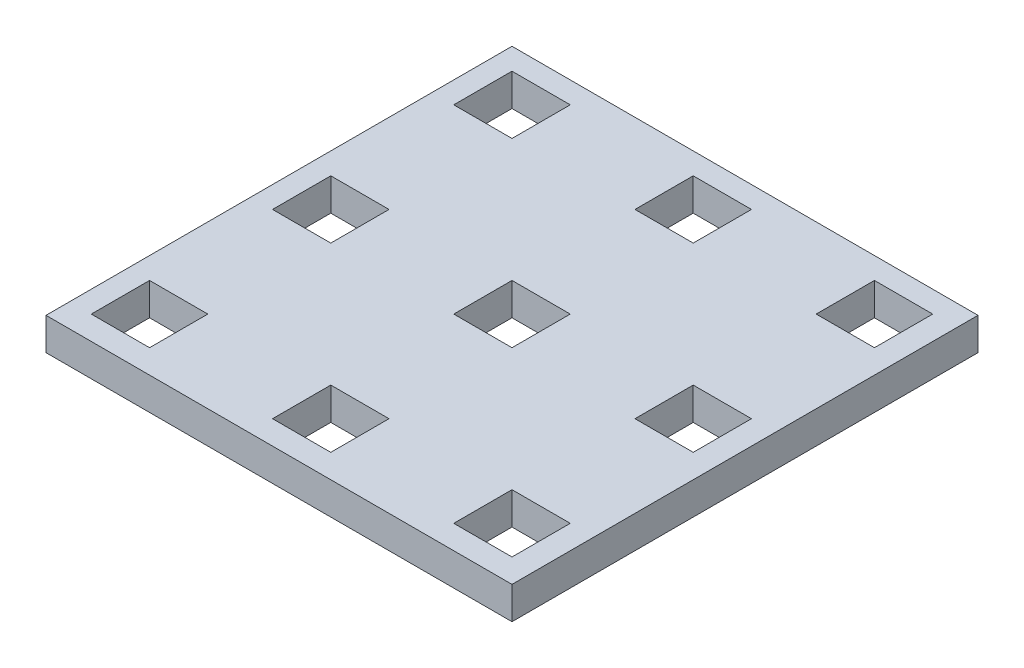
from build123d import *

# Parameters (mm, degrees)
SKETCH_1_W          = 43.2
SKETCH_1_H          = 43.2
EXTRUDE_1_DEPTH     = 3
SKETCH_2_W          = 5.4
SKETCH_2_H          = 5.4
CUT_EXTRUDE_1_DEPTH = 31.69397335


with BuildPart() as part:
    # Sketch 1 → Extrude 1 (new body)
    with BuildSketch(Plane(origin=(0, 0, 0), x_dir=(1, 0, 0), z_dir=(0, 1, 0))):
        Rectangle(SKETCH_1_W, SKETCH_1_H)
    extrude(amount=EXTRUDE_1_DEPTH)

    # Sketch 2 → Cut-Extrude 1 (cut, through all)
    with BuildSketch(Plane(origin=(0, 3, 0), x_dir=(1, 0, 0), z_dir=(0, 1, 0))):
        with Locations((-16.9, 16.9)):
            Rectangle(SKETCH_2_W, SKETCH_2_H)
        with Locations((-0.1, 16.9)):
            Rectangle(SKETCH_2_W, SKETCH_2_H)
        with Locations((16.7, 16.9)):
            Rectangle(SKETCH_2_W, SKETCH_2_H)
        with Locations((-0.1, 0.1)):
            Rectangle(SKETCH_2_W, SKETCH_2_H)
        with Locations((16.7, 0.1)):
            Rectangle(SKETCH_2_W, SKETCH_2_H)
        with Locations((-0.1, -16.7)):
            Rectangle(SKETCH_2_W, SKETCH_2_H)
        with Locations((16.7, -16.7)):
            Rectangle(SKETCH_2_W, SKETCH_2_H)
        with Locations((-16.9, 0.1)):
            Rectangle(SKETCH_2_W, SKETCH_2_H)
        with Locations((-16.9, -16.7)):
            Rectangle(SKETCH_2_W, SKETCH_2_H)
    extrude(amount=-CUT_EXTRUDE_1_DEPTH, mode=Mode.SUBTRACT)


solid = part.part
